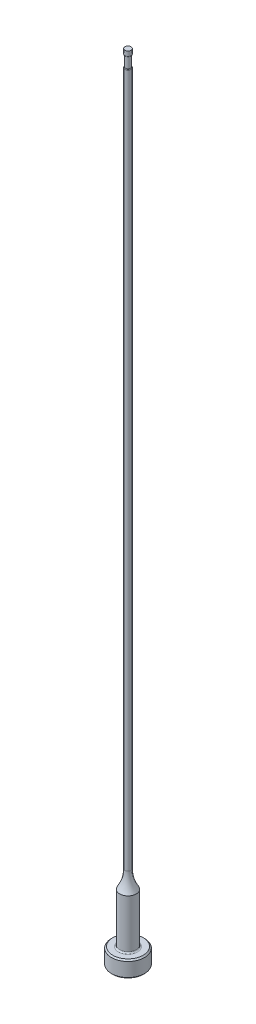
ISO-10303-21;
HEADER;
FILE_DESCRIPTION(('STEP AP214'),'2;1');
FILE_NAME('part.step','',(''),(''),'','','');
FILE_SCHEMA(('AUTOMOTIVE_DESIGN { 1 0 10303 214 1 1 1 1 }'));
ENDSEC;
DATA;
#1=APPLICATION_CONTEXT('core data for automotive mechanical design processes');
#2=APPLICATION_PROTOCOL_DEFINITION('international standard','automotive_design',2000,#1);
#3=PRODUCT_CONTEXT('',#1,'mechanical');
#4=PRODUCT('Part','Part','',(#3));
#5=PRODUCT_RELATED_PRODUCT_CATEGORY('part','',(#4));
#6=PRODUCT_DEFINITION_FORMATION('','',#4);
#7=PRODUCT_DEFINITION_CONTEXT('part definition',#1,'design');
#8=PRODUCT_DEFINITION('design','',#6,#7);
#9=PRODUCT_DEFINITION_SHAPE('','',#8);
#10=(LENGTH_UNIT() NAMED_UNIT(*) SI_UNIT(.MILLI.,.METRE.));
#11=(NAMED_UNIT(*) PLANE_ANGLE_UNIT() SI_UNIT($,.RADIAN.));
#12=(NAMED_UNIT(*) SI_UNIT($,.STERADIAN.) SOLID_ANGLE_UNIT());
#13=UNCERTAINTY_MEASURE_WITH_UNIT(LENGTH_MEASURE(1.E-05),#10,'distance_accuracy_value','');
#14=(GEOMETRIC_REPRESENTATION_CONTEXT(3) GLOBAL_UNCERTAINTY_ASSIGNED_CONTEXT((#13)) GLOBAL_UNIT_ASSIGNED_CONTEXT((#10,
#11,#12)) REPRESENTATION_CONTEXT('',''));
#15=CARTESIAN_POINT('',(0.,0.,0.));
#16=DIRECTION('',(0.,0.,1.));
#17=DIRECTION('',(1.,0.,0.));
#18=AXIS2_PLACEMENT_3D('',#15,#16,#17);
#19=CARTESIAN_POINT('',(0.,259.958771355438,0.));
#20=DIRECTION('',(0.,1.,0.));
#21=DIRECTION('',(0.,0.,1.));
#22=AXIS2_PLACEMENT_3D('',#19,#20,#21);
#23=CYLINDRICAL_SURFACE('',#22,0.594359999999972);
#24=DIRECTION('',(0.,1.,0.));
#25=VECTOR('',#24,1.);
#26=CARTESIAN_POINT('',(-0.492759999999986,259.958771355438,-0.332342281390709));
#27=LINE('',#26,#25);
#28=CARTESIAN_POINT('',(-0.492759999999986,149.227565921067,-0.332342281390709));
#29=VERTEX_POINT('',#28);
#30=CARTESIAN_POINT('',(-0.492759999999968,112.268,-0.332342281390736));
#31=VERTEX_POINT('',#30);
#32=EDGE_CURVE('E66',#29,#31,#27,.F.);
#33=ORIENTED_EDGE('',*,*,#32,.F.);
#34=CARTESIAN_POINT('',(0.,149.227565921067,0.));
#35=DIRECTION('',(0.,1.,0.));
#36=DIRECTION('',(0.,0.,1.));
#37=AXIS2_PLACEMENT_3D('',#34,#35,#36);
#38=CIRCLE('',#37,0.594359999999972);
#39=CARTESIAN_POINT('',(-0.492759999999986,149.227565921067,0.332342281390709));
#40=VERTEX_POINT('',#39);
#41=EDGE_CURVE('E44',#29,#40,#38,.F.);
#42=ORIENTED_EDGE('',*,*,#41,.T.);
#43=DIRECTION('',(0.,1.,0.));
#44=VECTOR('',#43,1.);
#45=CARTESIAN_POINT('',(-0.492759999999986,259.958771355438,0.332342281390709));
#46=LINE('',#45,#44);
#47=CARTESIAN_POINT('',(-0.492759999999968,112.268,0.332342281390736));
#48=VERTEX_POINT('',#47);
#49=EDGE_CURVE('E72',#48,#40,#46,.T.);
#50=ORIENTED_EDGE('',*,*,#49,.F.);
#51=CARTESIAN_POINT('',(-0.492759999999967,112.268,-0.332342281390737));
#52=CARTESIAN_POINT('',(-0.492756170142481,112.229819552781,-0.332315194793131));
#53=CARTESIAN_POINT('',(-0.493448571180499,112.191629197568,-0.331319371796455));
#54=CARTESIAN_POINT('',(-0.496205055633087,112.115285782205,-0.327194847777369));
#55=CARTESIAN_POINT('',(-0.498273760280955,112.077133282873,-0.324058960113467));
#56=CARTESIAN_POINT('',(-0.503877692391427,111.999578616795,-0.315274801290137));
#57=CARTESIAN_POINT('',(-0.507471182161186,111.96019174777,-0.309525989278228));
#58=CARTESIAN_POINT('',(-0.516046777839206,111.882172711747,-0.2950120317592));
#59=CARTESIAN_POINT('',(-0.521026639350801,111.843539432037,-0.286251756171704));
#60=CARTESIAN_POINT('',(-0.532127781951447,111.76813215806,-0.265038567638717));
#61=CARTESIAN_POINT('',(-0.538229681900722,111.731338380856,-0.252646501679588));
#62=CARTESIAN_POINT('',(-0.551257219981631,111.660296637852,-0.222825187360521));
#63=CARTESIAN_POINT('',(-0.55817243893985,111.626024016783,-0.205456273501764));
#64=CARTESIAN_POINT('',(-0.567358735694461,111.583706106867,-0.177255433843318));
#65=CARTESIAN_POINT('',(-0.569648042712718,111.573427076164,-0.169801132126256));
#66=CARTESIAN_POINT('',(-0.574154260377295,111.553625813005,-0.15388318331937));
#67=CARTESIAN_POINT('',(-0.576371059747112,111.54410471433,-0.14541806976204));
#68=CARTESIAN_POINT('',(-0.580650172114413,111.52606685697,-0.127266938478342));
#69=CARTESIAN_POINT('',(-0.582710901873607,111.517559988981,-0.1175705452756));
#70=CARTESIAN_POINT('',(-0.586499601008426,111.502152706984,-0.0969103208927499));
#71=CARTESIAN_POINT('',(-0.588228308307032,111.495248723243,-0.0859493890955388));
#72=CARTESIAN_POINT('',(-0.590708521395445,111.485442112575,-0.0662855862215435));
#73=CARTESIAN_POINT('',(-0.591597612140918,111.48196041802,-0.0578911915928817));
#74=CARTESIAN_POINT('',(-0.593032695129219,111.476365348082,-0.040629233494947));
#75=CARTESIAN_POINT('',(-0.593579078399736,111.474250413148,-0.0317622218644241));
#76=CARTESIAN_POINT('',(-0.594270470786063,111.471577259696,-0.0137206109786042));
#77=CARTESIAN_POINT('',(-0.594413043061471,111.471028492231,-0.00454448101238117));
#78=CARTESIAN_POINT('',(-0.59427126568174,111.471575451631,0.0137560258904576));
#79=CARTESIAN_POINT('',(-0.593986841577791,111.472671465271,0.022880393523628));
#80=CARTESIAN_POINT('',(-0.593063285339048,111.476250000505,0.0401088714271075));
#81=CARTESIAN_POINT('',(-0.592452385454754,111.478622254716,0.048238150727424));
#82=CARTESIAN_POINT('',(-0.590952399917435,111.484489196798,0.0640487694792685));
#83=CARTESIAN_POINT('',(-0.590063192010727,111.48798437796,0.0717299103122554));
#84=CARTESIAN_POINT('',(-0.587497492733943,111.498163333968,0.0908266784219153));
#85=CARTESIAN_POINT('',(-0.585661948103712,111.505526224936,0.101857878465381));
#86=CARTESIAN_POINT('',(-0.581672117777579,111.521837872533,0.122611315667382));
#87=CARTESIAN_POINT('',(-0.579516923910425,111.53079116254,0.132329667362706));
#88=CARTESIAN_POINT('',(-0.573410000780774,111.556730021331,0.157262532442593));
#89=CARTESIAN_POINT('',(-0.569297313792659,111.574800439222,0.171297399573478));
#90=CARTESIAN_POINT('',(-0.561050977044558,111.612739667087,0.196626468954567));
#91=CARTESIAN_POINT('',(-0.556917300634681,111.632613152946,0.207913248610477));
#92=CARTESIAN_POINT('',(-0.548723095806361,111.674118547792,0.228681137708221));
#93=CARTESIAN_POINT('',(-0.544669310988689,111.69578661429,0.238091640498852));
#94=CARTESIAN_POINT('',(-0.536909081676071,111.739888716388,0.255105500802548));
#95=CARTESIAN_POINT('',(-0.533203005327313,111.76232353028,0.262706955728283));
#96=CARTESIAN_POINT('',(-0.522705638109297,111.830539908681,0.283349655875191));
#97=CARTESIAN_POINT('',(-0.516562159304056,111.877099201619,0.29416845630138));
#98=CARTESIAN_POINT('',(-0.508338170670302,111.952558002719,0.308040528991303));
#99=CARTESIAN_POINT('',(-0.505611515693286,111.981164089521,0.312472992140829));
#100=CARTESIAN_POINT('',(-0.500924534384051,112.038636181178,0.319935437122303));
#101=CARTESIAN_POINT('',(-0.498964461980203,112.067502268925,0.322964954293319));
#102=CARTESIAN_POINT('',(-0.495855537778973,112.124951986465,0.327718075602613));
#103=CARTESIAN_POINT('',(-0.494695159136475,112.153533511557,0.329460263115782));
#104=CARTESIAN_POINT('',(-0.493147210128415,112.210743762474,0.331767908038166));
#105=CARTESIAN_POINT('',(-0.492759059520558,112.239372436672,0.332334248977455));
#106=CARTESIAN_POINT('',(-0.492759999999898,112.267999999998,0.332342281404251));
#107=B_SPLINE_CURVE_WITH_KNOTS('',3,(#51,#52,#53,#54,#55,#56,#57,#58,#59,#60,#61,#62,#63,#64,
#65,#66,#67,#68,#69,#70,#71,#72,#73,#74,#75,#76,#77,#78,#79,#80,#81,#82,#83,#84,#85,#86,#87,#88,
#89,#90,#91,#92,#93,#94,#95,#96,#97,#98,#99,#100,#101,#102,#103,#104,#105,#106),.UNSPECIFIED.,
.F.,.F.,(4,2,2,2,2,2,2,2,2,2,2,2,2,2,2,2,2,2,2,2,2,2,2,2,2,2,2,4),(0.,0.114538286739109,
0.229463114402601,0.349243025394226,0.468830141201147,0.586518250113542,0.702835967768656,
0.741495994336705,0.780212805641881,0.819280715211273,0.85826076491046,0.885552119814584,
0.912812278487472,0.940236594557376,0.967665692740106,0.993035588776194,1.01841664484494,
1.05835278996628,1.09840465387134,1.16775387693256,1.23728838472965,1.30908278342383,
1.38095235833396,1.52513678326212,1.61233352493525,1.69955912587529,1.78549956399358,
1.87137540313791),.UNSPECIFIED.);
#108=EDGE_CURVE('E74',#31,#48,#107,.T.);
#109=ORIENTED_EDGE('',*,*,#108,.F.);
#110=EDGE_LOOP('',(#33,#42,#50,#109));
#111=FACE_BOUND('',#110,.T.);
#112=CARTESIAN_POINT('',(0.,16.1097728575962,0.));
#113=DIRECTION('',(0.,1.,0.));
#114=DIRECTION('',(0.,0.,1.));
#115=AXIS2_PLACEMENT_3D('',#112,#113,#114);
#116=CIRCLE('',#115,0.594359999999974);
#117=CARTESIAN_POINT('',(0.,16.1097728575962,0.594359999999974));
#118=VERTEX_POINT('',#117);
#119=EDGE_CURVE('E95',#118,#118,#116,.T.);
#120=ORIENTED_EDGE('',*,*,#119,.T.);
#121=EDGE_LOOP('',(#120));
#122=FACE_BOUND('',#121,.T.);
#123=ADVANCED_FACE('F36',(#111,#122),#23,.T.);
#124=CARTESIAN_POINT('',(0.,16.1097728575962,0.));
#125=DIRECTION('',(0.,1.,0.));
#126=DIRECTION('',(0.,0.,1.));
#127=AXIS2_PLACEMENT_3D('',#124,#125,#126);
#128=TOROIDAL_SURFACE('',#127,6.94435999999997,6.35);
#129=CARTESIAN_POINT('',(0.,12.7,0.));
#130=DIRECTION('',(0.,1.,0.));
#131=DIRECTION('',(0.,0.,1.));
#132=AXIS2_PLACEMENT_3D('',#129,#130,#131);
#133=CIRCLE('',#132,1.58749999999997);
#134=CARTESIAN_POINT('',(0.,12.7,1.58749999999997));
#135=VERTEX_POINT('',#134);
#136=EDGE_CURVE('E92',#135,#135,#133,.T.);
#137=ORIENTED_EDGE('',*,*,#136,.T.);
#138=EDGE_LOOP('',(#137));
#139=FACE_BOUND('',#138,.T.);
#140=ORIENTED_EDGE('',*,*,#119,.F.);
#141=EDGE_LOOP('',(#140));
#142=FACE_BOUND('',#141,.T.);
#143=ADVANCED_FACE('F156',(#139,#142),#128,.F.);
#144=CARTESIAN_POINT('',(0.,259.958771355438,0.));
#145=DIRECTION('',(0.,1.,0.));
#146=DIRECTION('',(0.,0.,1.));
#147=AXIS2_PLACEMENT_3D('',#144,#145,#146);
#148=CYLINDRICAL_SURFACE('',#147,1.58749999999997);
#149=CARTESIAN_POINT('',(0.,3.42900000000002,0.));
#150=DIRECTION('',(0.,1.,0.));
#151=DIRECTION('',(0.,0.,1.));
#152=AXIS2_PLACEMENT_3D('',#149,#150,#151);
#153=CIRCLE('',#152,1.58749999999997);
#154=CARTESIAN_POINT('',(0.,3.42900000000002,1.58749999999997));
#155=VERTEX_POINT('',#154);
#156=EDGE_CURVE('E110',#155,#155,#153,.T.);
#157=ORIENTED_EDGE('',*,*,#156,.T.);
#158=EDGE_LOOP('',(#157));
#159=FACE_BOUND('',#158,.T.);
#160=ORIENTED_EDGE('',*,*,#136,.F.);
#161=EDGE_LOOP('',(#160));
#162=FACE_BOUND('',#161,.T.);
#163=ADVANCED_FACE('F153',(#159,#162),#148,.T.);
#164=CARTESIAN_POINT('',(-3.17499999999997,3.175,0.));
#165=DIRECTION('',(0.,1.,0.));
#166=DIRECTION('',(0.,0.,1.));
#167=AXIS2_PLACEMENT_3D('',#164,#165,#166);
#168=PLANE('',#167);
#169=CARTESIAN_POINT('',(0.,3.175,0.));
#170=DIRECTION('',(0.,1.,0.));
#171=DIRECTION('',(0.,0.,1.));
#172=AXIS2_PLACEMENT_3D('',#169,#170,#171);
#173=CIRCLE('',#172,1.84149999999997);
#174=CARTESIAN_POINT('',(0.,3.175,1.84149999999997));
#175=VERTEX_POINT('',#174);
#176=EDGE_CURVE('E78',#175,#175,#173,.F.);
#177=ORIENTED_EDGE('',*,*,#176,.T.);
#178=EDGE_LOOP('',(#177));
#179=FACE_BOUND('',#178,.T.);
#180=CARTESIAN_POINT('',(0.,3.175,0.));
#181=DIRECTION('',(0.,1.,0.));
#182=DIRECTION('',(0.,0.,1.));
#183=AXIS2_PLACEMENT_3D('',#180,#181,#182);
#184=CIRCLE('',#183,2.92099999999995);
#185=CARTESIAN_POINT('',(0.,3.175,2.92099999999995));
#186=VERTEX_POINT('',#185);
#187=EDGE_CURVE('E98',#186,#186,#184,.T.);
#188=ORIENTED_EDGE('',*,*,#187,.T.);
#189=EDGE_LOOP('',(#188));
#190=FACE_BOUND('',#189,.T.);
#191=ADVANCED_FACE('F149',(#179,#190),#168,.T.);
#192=CARTESIAN_POINT('',(0.,259.958771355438,0.));
#193=DIRECTION('',(0.,1.,0.));
#194=DIRECTION('',(0.,0.,1.));
#195=AXIS2_PLACEMENT_3D('',#192,#193,#194);
#196=CYLINDRICAL_SURFACE('',#195,3.17499999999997);
#197=CARTESIAN_POINT('',(0.,2.92100000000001,0.));
#198=DIRECTION('',(0.,1.,0.));
#199=DIRECTION('',(0.,0.,1.));
#200=AXIS2_PLACEMENT_3D('',#197,#198,#199);
#201=CIRCLE('',#200,3.17499999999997);
#202=CARTESIAN_POINT('',(0.,2.92100000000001,3.17499999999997));
#203=VERTEX_POINT('',#202);
#204=EDGE_CURVE('E104',#203,#203,#201,.F.);
#205=ORIENTED_EDGE('',*,*,#204,.T.);
#206=EDGE_LOOP('',(#205));
#207=FACE_BOUND('',#206,.T.);
#208=CARTESIAN_POINT('',(0.,0.254000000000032,0.));
#209=DIRECTION('',(0.,-1.,0.));
#210=DIRECTION('',(0.,0.,-1.));
#211=AXIS2_PLACEMENT_3D('',#208,#209,#210);
#212=CIRCLE('',#211,3.17499999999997);
#213=CARTESIAN_POINT('',(0.,0.254000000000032,-3.17499999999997));
#214=VERTEX_POINT('',#213);
#215=EDGE_CURVE('E101',#214,#214,#212,.F.);
#216=ORIENTED_EDGE('',*,*,#215,.T.);
#217=EDGE_LOOP('',(#216));
#218=FACE_BOUND('',#217,.T.);
#219=ADVANCED_FACE('F145',(#207,#218),#196,.T.);
#220=CARTESIAN_POINT('',(0.,0.,0.));
#221=DIRECTION('',(0.,-1.,0.));
#222=DIRECTION('',(0.,0.,-1.));
#223=AXIS2_PLACEMENT_3D('',#220,#221,#222);
#224=PLANE('',#223);
#225=CARTESIAN_POINT('',(0.,0.,0.));
#226=DIRECTION('',(0.,-1.,0.));
#227=DIRECTION('',(0.,0.,-1.));
#228=AXIS2_PLACEMENT_3D('',#225,#226,#227);
#229=CIRCLE('',#228,2.92099999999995);
#230=CARTESIAN_POINT('',(0.,0.,-2.92099999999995));
#231=VERTEX_POINT('',#230);
#232=EDGE_CURVE('E107',#231,#231,#229,.T.);
#233=ORIENTED_EDGE('',*,*,#232,.T.);
#234=EDGE_LOOP('',(#233));
#235=FACE_BOUND('',#234,.T.);
#236=ADVANCED_FACE('F141',(#235),#224,.T.);
#237=CARTESIAN_POINT('',(0.,3.17499999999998,0.));
#238=DIRECTION('',(0.,-1.,0.));
#239=DIRECTION('',(0.,0.,-1.));
#240=AXIS2_PLACEMENT_3D('',#237,#238,#239);
#241=CONICAL_SURFACE('',#240,2.92099999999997,0.7853981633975);
#242=ORIENTED_EDGE('',*,*,#204,.F.);
#243=EDGE_LOOP('',(#242));
#244=FACE_BOUND('',#243,.T.);
#245=ORIENTED_EDGE('',*,*,#187,.F.);
#246=EDGE_LOOP('',(#245));
#247=FACE_BOUND('',#246,.T.);
#248=ADVANCED_FACE('F144',(#244,#247),#241,.T.);
#249=CARTESIAN_POINT('',(0.,0.254000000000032,0.));
#250=DIRECTION('',(0.,1.,0.));
#251=DIRECTION('',(0.,0.,1.));
#252=AXIS2_PLACEMENT_3D('',#249,#250,#251);
#253=CONICAL_SURFACE('',#252,3.17499999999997,0.785398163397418);
#254=ORIENTED_EDGE('',*,*,#232,.F.);
#255=EDGE_LOOP('',(#254));
#256=FACE_BOUND('',#255,.T.);
#257=ORIENTED_EDGE('',*,*,#215,.F.);
#258=EDGE_LOOP('',(#257));
#259=FACE_BOUND('',#258,.T.);
#260=ADVANCED_FACE('F245',(#256,#259),#253,.T.);
#261=CARTESIAN_POINT('',(0.,3.42900000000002,0.));
#262=DIRECTION('',(0.,1.,0.));
#263=DIRECTION('',(0.,0.,1.));
#264=AXIS2_PLACEMENT_3D('',#261,#262,#263);
#265=TOROIDAL_SURFACE('',#264,1.84149999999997,0.254);
#266=ORIENTED_EDGE('',*,*,#176,.F.);
#267=EDGE_LOOP('',(#266));
#268=FACE_BOUND('',#267,.T.);
#269=ORIENTED_EDGE('',*,*,#156,.F.);
#270=EDGE_LOOP('',(#269));
#271=FACE_BOUND('',#270,.T.);
#272=ADVANCED_FACE('F139',(#268,#271),#265,.F.);
#273=CARTESIAN_POINT('',(0.,153.448281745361,0.));
#274=DIRECTION('',(0.,1.,0.));
#275=DIRECTION('',(0.,0.,1.));
#276=AXIS2_PLACEMENT_3D('',#273,#274,#275);
#277=CYLINDRICAL_SURFACE('',#276,0.492759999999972);
#278=CARTESIAN_POINT('',(0.,151.384,0.));
#279=DIRECTION('',(0.,1.,0.));
#280=DIRECTION('',(0.,0.,1.));
#281=AXIS2_PLACEMENT_3D('',#278,#279,#280);
#282=CIRCLE('',#281,0.492759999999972);
#283=CARTESIAN_POINT('',(0.,151.384,0.492759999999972));
#284=VERTEX_POINT('',#283);
#285=EDGE_CURVE('E71',#284,#284,#282,.T.);
#286=ORIENTED_EDGE('',*,*,#285,.F.);
#287=EDGE_LOOP('',(#286));
#288=FACE_BOUND('',#287,.T.);
#289=CARTESIAN_POINT('',(0.,149.352,0.));
#290=DIRECTION('',(0.,1.,0.));
#291=DIRECTION('',(0.,0.,1.));
#292=AXIS2_PLACEMENT_3D('',#289,#290,#291);
#293=CIRCLE('',#292,0.492759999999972);
#294=CARTESIAN_POINT('',(-0.492759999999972,149.352,0.));
#295=VERTEX_POINT('',#294);
#296=EDGE_CURVE('E89',#295,#295,#293,.T.);
#297=ORIENTED_EDGE('',*,*,#296,.T.);
#298=EDGE_LOOP('',(#297));
#299=FACE_BOUND('',#298,.T.);
#300=ADVANCED_FACE('F136',(#288,#299),#277,.T.);
#301=CARTESIAN_POINT('',(-0.492759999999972,150.368,-3.17499999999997));
#302=DIRECTION('',(1.,0.,0.));
#303=DIRECTION('',(0.,1.,0.));
#304=AXIS2_PLACEMENT_3D('',#301,#302,#303);
#305=PLANE('',#304);
#306=CARTESIAN_POINT('',(-0.492759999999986,149.227565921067,0.332342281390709));
#307=CARTESIAN_POINT('',(-0.492759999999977,149.23245108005,0.332357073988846));
#308=CARTESIAN_POINT('',(-0.492759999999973,149.237318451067,0.331839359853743));
#309=CARTESIAN_POINT('',(-0.492759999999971,149.246805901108,0.329871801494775));
#310=CARTESIAN_POINT('',(-0.492759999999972,149.251428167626,0.328432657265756));
#311=CARTESIAN_POINT('',(-0.492759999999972,149.260313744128,0.324757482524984));
#312=CARTESIAN_POINT('',(-0.492759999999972,149.264578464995,0.322524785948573));
#313=CARTESIAN_POINT('',(-0.492759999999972,149.272714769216,0.317418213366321));
#314=CARTESIAN_POINT('',(-0.492759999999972,149.276585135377,0.314542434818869));
#315=CARTESIAN_POINT('',(-0.492759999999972,149.285640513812,0.306816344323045));
#316=CARTESIAN_POINT('',(-0.492759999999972,149.290577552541,0.30167671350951));
#317=CARTESIAN_POINT('',(-0.492759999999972,149.299587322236,0.290701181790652));
#318=CARTESIAN_POINT('',(-0.492759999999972,149.303658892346,0.28486436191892));
#319=CARTESIAN_POINT('',(-0.492759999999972,149.313607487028,0.268553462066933));
#320=CARTESIAN_POINT('',(-0.492759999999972,149.318790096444,0.257660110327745));
#321=CARTESIAN_POINT('',(-0.492759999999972,149.327580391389,0.235187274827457));
#322=CARTESIAN_POINT('',(-0.492759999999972,149.331173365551,0.223602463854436));
#323=CARTESIAN_POINT('',(-0.492759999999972,149.338704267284,0.19416767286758));
#324=CARTESIAN_POINT('',(-0.492759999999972,149.341886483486,0.176130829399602));
#325=CARTESIAN_POINT('',(-0.492759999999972,149.346644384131,0.139809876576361));
#326=CARTESIAN_POINT('',(-0.492759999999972,149.348213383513,0.121525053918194));
#327=CARTESIAN_POINT('',(-0.492759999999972,149.350380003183,0.0859638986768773));
#328=CARTESIAN_POINT('',(-0.492759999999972,149.35102849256,0.0686903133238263));
#329=CARTESIAN_POINT('',(-0.492759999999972,149.351816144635,0.0342749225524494));
#330=CARTESIAN_POINT('',(-0.492759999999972,149.351959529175,0.0171332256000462));
#331=CARTESIAN_POINT('',(-0.492759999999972,149.352,0.));
#332=B_SPLINE_CURVE_WITH_KNOTS('',3,(#306,#307,#308,#309,#310,#311,#312,#313,#314,#315,#316,
#317,#318,#319,#320,#321,#322,#323,#324,#325,#326,#327,#328,#329,#330,#331),.UNSPECIFIED.,.F.,
.F.,(4,2,2,2,2,2,2,2,2,2,2,2,4),(0.,0.0145999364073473,0.0290333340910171,0.0434067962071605,
0.0578233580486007,0.0790827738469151,0.100370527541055,0.136356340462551,0.172668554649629,
0.227468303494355,0.28249423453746,0.334342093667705,0.38575554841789),.UNSPECIFIED.);
#333=EDGE_CURVE('E77',#40,#295,#332,.T.);
#334=ORIENTED_EDGE('',*,*,#333,.T.);
#335=CARTESIAN_POINT('',(-0.492759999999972,149.352,0.));
#336=CARTESIAN_POINT('',(-0.492759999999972,149.351956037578,-0.0174712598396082));
#337=CARTESIAN_POINT('',(-0.492759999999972,149.351808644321,-0.034952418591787));
#338=CARTESIAN_POINT('',(-0.492759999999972,149.350987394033,-0.0700519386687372));
#339=CARTESIAN_POINT('',(-0.492759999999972,149.350308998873,-0.087670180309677));
#340=CARTESIAN_POINT('',(-0.492759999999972,149.348066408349,-0.123326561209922));
#341=CARTESIAN_POINT('',(-0.492759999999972,149.346479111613,-0.14136339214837));
#342=CARTESIAN_POINT('',(-0.492759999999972,149.341706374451,-0.177190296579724));
#343=CARTESIAN_POINT('',(-0.492759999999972,149.338527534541,-0.194981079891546));
#344=CARTESIAN_POINT('',(-0.492759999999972,149.331991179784,-0.220348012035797));
#345=CARTESIAN_POINT('',(-0.492759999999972,149.329682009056,-0.228189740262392));
#346=CARTESIAN_POINT('',(-0.492759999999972,149.324387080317,-0.243637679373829));
#347=CARTESIAN_POINT('',(-0.492759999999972,149.321402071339,-0.251244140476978));
#348=CARTESIAN_POINT('',(-0.492759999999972,149.314570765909,-0.26615219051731));
#349=CARTESIAN_POINT('',(-0.492759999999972,149.310716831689,-0.273450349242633));
#350=CARTESIAN_POINT('',(-0.492759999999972,149.301983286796,-0.287413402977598));
#351=CARTESIAN_POINT('',(-0.492759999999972,149.297105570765,-0.294079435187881));
#352=CARTESIAN_POINT('',(-0.492759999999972,149.288143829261,-0.304142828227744));
#353=CARTESIAN_POINT('',(-0.492759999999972,149.284410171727,-0.307850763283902));
#354=CARTESIAN_POINT('',(-0.492759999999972,149.276437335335,-0.314683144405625));
#355=CARTESIAN_POINT('',(-0.492759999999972,149.272198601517,-0.317808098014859));
#356=CARTESIAN_POINT('',(-0.492759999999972,149.263908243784,-0.322875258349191));
#357=CARTESIAN_POINT('',(-0.492759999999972,149.259922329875,-0.324924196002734));
#358=CARTESIAN_POINT('',(-0.492759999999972,149.251667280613,-0.328328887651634));
#359=CARTESIAN_POINT('',(-0.492759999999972,149.247398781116,-0.329686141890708));
#360=CARTESIAN_POINT('',(-0.492759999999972,149.240507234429,-0.331205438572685));
#361=CARTESIAN_POINT('',(-0.492759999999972,149.237940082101,-0.33162986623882));
#362=CARTESIAN_POINT('',(-0.492759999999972,149.232771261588,-0.332199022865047));
#363=CARTESIAN_POINT('',(-0.492759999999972,149.230169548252,-0.33234334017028));
#364=CARTESIAN_POINT('',(-0.492759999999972,149.227565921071,-0.332342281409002));
#365=B_SPLINE_CURVE_WITH_KNOTS('',3,(#335,#336,#337,#338,#339,#340,#341,#342,#343,#344,#345,
#346,#347,#348,#349,#350,#351,#352,#353,#354,#355,#356,#357,#358,#359,#360,#361,#362,#363,#364),
.UNSPECIFIED.,.F.,.F.,(4,2,2,2,2,2,2,2,2,2,2,2,2,2,4),(0.,0.0524301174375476,0.10531327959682,
0.159604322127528,0.21367204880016,0.238172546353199,0.262646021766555,0.287343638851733,
0.311995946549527,0.327737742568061,0.343465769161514,0.356857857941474,0.370220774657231,
0.378012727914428,0.385816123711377),.UNSPECIFIED.);
#366=EDGE_CURVE('E58',#295,#29,#365,.T.);
#367=ORIENTED_EDGE('',*,*,#366,.T.);
#368=ORIENTED_EDGE('',*,*,#32,.T.);
#369=DIRECTION('',(0.,0.,1.));
#370=VECTOR('',#369,1.);
#371=CARTESIAN_POINT('',(-0.492759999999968,112.268,-3.17499999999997));
#372=LINE('',#371,#370);
#373=EDGE_CURVE('E70',#31,#48,#372,.T.);
#374=ORIENTED_EDGE('',*,*,#373,.T.);
#375=ORIENTED_EDGE('',*,*,#49,.T.);
#376=EDGE_LOOP('',(#334,#367,#368,#374,#375));
#377=FACE_BOUND('',#376,.T.);
#378=ADVANCED_FACE('F68',(#377),#305,.F.);
#379=CARTESIAN_POINT('',(-3.66775999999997,112.268,-3.17499999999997));
#380=DIRECTION('',(0.,0.,1.));
#381=DIRECTION('',(1.,0.,0.));
#382=AXIS2_PLACEMENT_3D('',#379,#380,#381);
#383=CYLINDRICAL_SURFACE('',#382,3.175);
#384=ORIENTED_EDGE('',*,*,#373,.F.);
#385=ORIENTED_EDGE('',*,*,#108,.T.);
#386=EDGE_LOOP('',(#384,#385));
#387=FACE_BOUND('',#386,.T.);
#388=ADVANCED_FACE('F80',(#387),#383,.F.);
#389=CARTESIAN_POINT('',(0.,152.687735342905,0.));
#390=DIRECTION('',(0.,1.,0.));
#391=DIRECTION('',(0.,0.,1.));
#392=AXIS2_PLACEMENT_3D('',#389,#390,#391);
#393=CYLINDRICAL_SURFACE('',#392,0.589279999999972);
#394=CARTESIAN_POINT('',(0.,151.507288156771,0.));
#395=DIRECTION('',(0.,-1.,0.));
#396=DIRECTION('',(0.,0.,-1.));
#397=AXIS2_PLACEMENT_3D('',#394,#395,#396);
#398=CIRCLE('',#397,0.589279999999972);
#399=CARTESIAN_POINT('',(0.,151.507288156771,-0.589279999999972));
#400=VERTEX_POINT('',#399);
#401=EDGE_CURVE('E11',#400,#400,#398,.F.);
#402=ORIENTED_EDGE('',*,*,#401,.T.);
#403=EDGE_LOOP('',(#402));
#404=FACE_BOUND('',#403,.T.);
#405=CARTESIAN_POINT('',(0.,152.4,0.));
#406=DIRECTION('',(0.,1.,0.));
#407=DIRECTION('',(0.,0.,1.));
#408=AXIS2_PLACEMENT_3D('',#405,#406,#407);
#409=CIRCLE('',#408,0.589279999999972);
#410=CARTESIAN_POINT('',(0.,152.4,0.589279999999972));
#411=VERTEX_POINT('',#410);
#412=EDGE_CURVE('E81',#411,#411,#409,.T.);
#413=ORIENTED_EDGE('',*,*,#412,.F.);
#414=EDGE_LOOP('',(#413));
#415=FACE_BOUND('',#414,.T.);
#416=ADVANCED_FACE('F133',(#404,#415),#393,.T.);
#417=CARTESIAN_POINT('',(-0.59435999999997,152.4,0.));
#418=DIRECTION('',(0.,1.,0.));
#419=DIRECTION('',(0.,0.,1.));
#420=AXIS2_PLACEMENT_3D('',#417,#418,#419);
#421=PLANE('',#420);
#422=ORIENTED_EDGE('',*,*,#412,.T.);
#423=EDGE_LOOP('',(#422));
#424=FACE_BOUND('',#423,.T.);
#425=ADVANCED_FACE('F177',(#424),#421,.T.);
#426=CARTESIAN_POINT('',(0.,149.227565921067,0.));
#427=DIRECTION('',(0.,1.,0.));
#428=DIRECTION('',(0.,0.,1.));
#429=AXIS2_PLACEMENT_3D('',#426,#427,#428);
#430=TOROIDAL_SURFACE('',#429,0.467359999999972,0.127);
#431=ORIENTED_EDGE('',*,*,#333,.F.);
#432=ORIENTED_EDGE('',*,*,#41,.F.);
#433=ORIENTED_EDGE('',*,*,#366,.F.);
#434=ORIENTED_EDGE('',*,*,#296,.F.);
#435=EDGE_LOOP('',(#431,#432,#433,#434));
#436=FACE_BOUND('',#435,.T.);
#437=ADVANCED_FACE('F209',(#436),#430,.T.);
#438=CARTESIAN_POINT('',(0.,151.507288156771,0.));
#439=DIRECTION('',(0.,-1.,0.));
#440=DIRECTION('',(0.,0.,-1.));
#441=AXIS2_PLACEMENT_3D('',#438,#439,#440);
#442=TOROIDAL_SURFACE('',#441,0.462279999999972,0.127);
#443=ORIENTED_EDGE('',*,*,#285,.T.);
#444=EDGE_LOOP('',(#443));
#445=FACE_BOUND('',#444,.T.);
#446=ORIENTED_EDGE('',*,*,#401,.F.);
#447=EDGE_LOOP('',(#446));
#448=FACE_BOUND('',#447,.T.);
#449=ADVANCED_FACE('F38',(#445,#448),#442,.T.);
#450=CLOSED_SHELL('',(#123,#143,#163,#191,#219,#236,#248,#260,#272,#300,#378,#388,#416,#425,
#437,#449));
#451=MANIFOLD_SOLID_BREP('B2',#450);
#452=ADVANCED_BREP_SHAPE_REPRESENTATION('',(#18,#451),#14);
#453=SHAPE_DEFINITION_REPRESENTATION(#9,#452);
ENDSEC;
END-ISO-10303-21;
